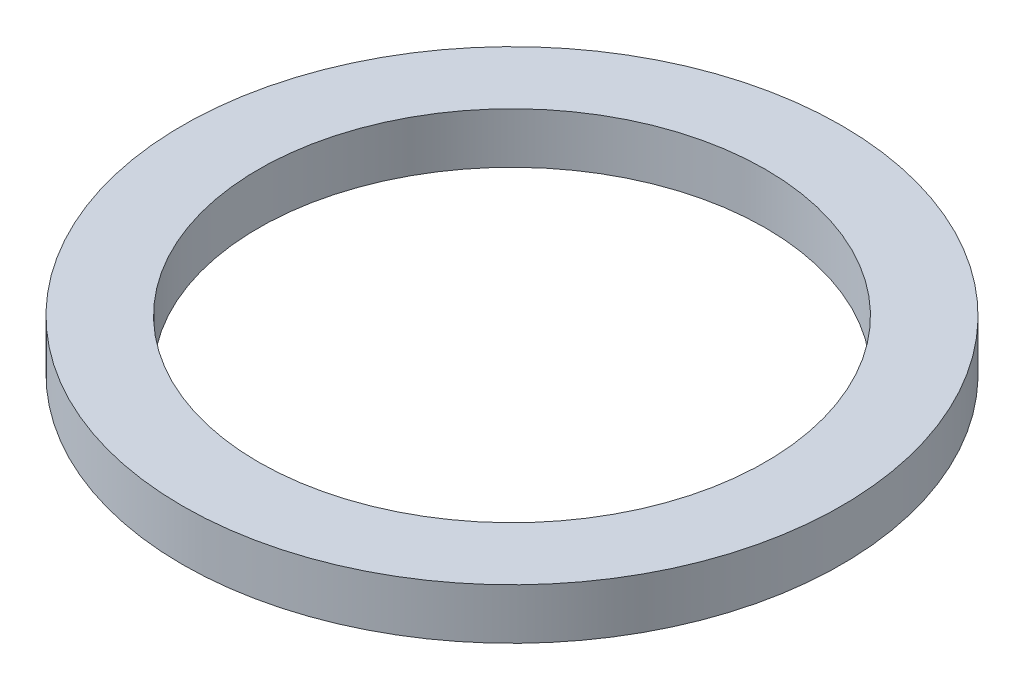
from build123d import *

# Parameters (mm, degrees)
ESQUISSE1_R          = 6.5
ESQUISSE1_R_2        = 5
BASE_EXTRUSION_DEPTH = 0.5


with BuildPart() as part:
    # Esquisse1 → Base-Extrusion (new, symmetric)
    with BuildSketch(Plane(origin=(0, 0, 0), x_dir=(1, 0, 0), z_dir=(0, 1, 0))):
        with Locations(Location((0, 0, 0), (0, 0, 270))):
            Circle(ESQUISSE1_R)
        with Locations(Location((0, 0, 0), (0, 0, 270))):
            Circle(ESQUISSE1_R_2, mode=Mode.SUBTRACT)
    extrude(amount=BASE_EXTRUSION_DEPTH, both=True)


solid = part.part
